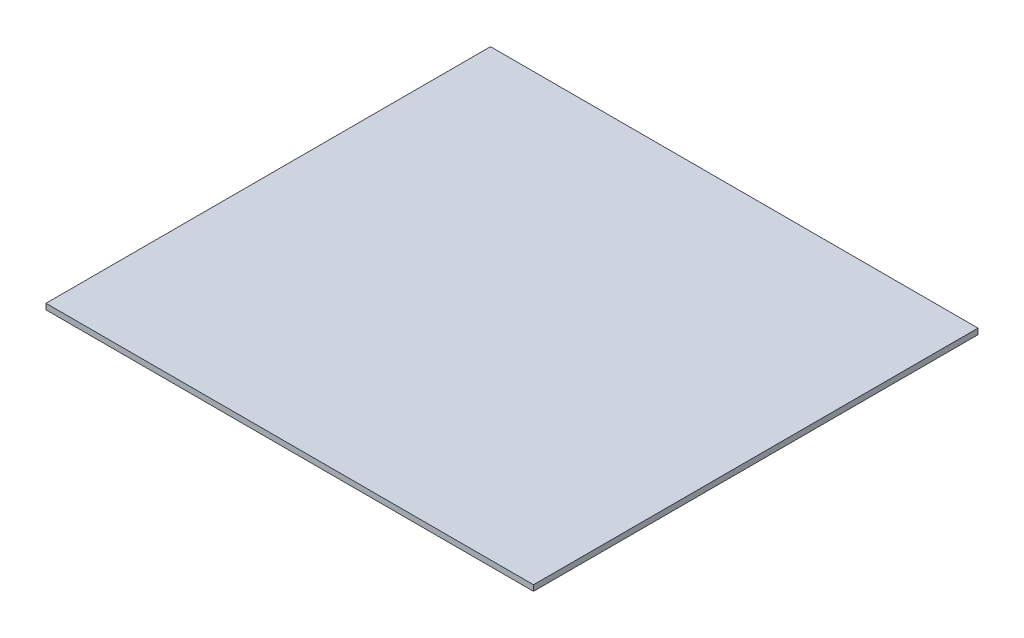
ISO-10303-21;
HEADER;
FILE_DESCRIPTION(('STEP AP214'),'2;1');
FILE_NAME('part.step','',(''),(''),'','','');
FILE_SCHEMA(('AUTOMOTIVE_DESIGN { 1 0 10303 214 1 1 1 1 }'));
ENDSEC;
DATA;
#1=APPLICATION_CONTEXT('core data for automotive mechanical design processes');
#2=APPLICATION_PROTOCOL_DEFINITION('international standard','automotive_design',2000,#1);
#3=PRODUCT_CONTEXT('',#1,'mechanical');
#4=PRODUCT('Part','Part','',(#3));
#5=PRODUCT_RELATED_PRODUCT_CATEGORY('part','',(#4));
#6=PRODUCT_DEFINITION_FORMATION('','',#4);
#7=PRODUCT_DEFINITION_CONTEXT('part definition',#1,'design');
#8=PRODUCT_DEFINITION('design','',#6,#7);
#9=PRODUCT_DEFINITION_SHAPE('','',#8);
#10=(LENGTH_UNIT() NAMED_UNIT(*) SI_UNIT(.MILLI.,.METRE.));
#11=(NAMED_UNIT(*) PLANE_ANGLE_UNIT() SI_UNIT($,.RADIAN.));
#12=(NAMED_UNIT(*) SI_UNIT($,.STERADIAN.) SOLID_ANGLE_UNIT());
#13=UNCERTAINTY_MEASURE_WITH_UNIT(LENGTH_MEASURE(1.E-05),#10,'distance_accuracy_value','');
#14=(GEOMETRIC_REPRESENTATION_CONTEXT(3) GLOBAL_UNCERTAINTY_ASSIGNED_CONTEXT((#13)) GLOBAL_UNIT_ASSIGNED_CONTEXT((#10,
#11,#12)) REPRESENTATION_CONTEXT('',''));
#15=CARTESIAN_POINT('',(0.,0.,0.));
#16=DIRECTION('',(0.,0.,1.));
#17=DIRECTION('',(1.,0.,0.));
#18=AXIS2_PLACEMENT_3D('',#15,#16,#17);
#19=CARTESIAN_POINT('',(108.072104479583,2.54,98.5395029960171));
#20=DIRECTION('',(-1.,0.,0.));
#21=DIRECTION('',(0.,0.,1.));
#22=AXIS2_PLACEMENT_3D('',#19,#20,#21);
#23=PLANE('',#22);
#24=DIRECTION('',(0.,0.,-1.));
#25=VECTOR('',#24,1.);
#26=CARTESIAN_POINT('',(108.072104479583,0.,98.5395029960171));
#27=LINE('',#26,#25);
#28=CARTESIAN_POINT('',(108.072104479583,0.,98.5395029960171));
#29=VERTEX_POINT('',#28);
#30=CARTESIAN_POINT('',(108.072104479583,0.,-98.5395029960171));
#31=VERTEX_POINT('',#30);
#32=EDGE_CURVE('E107',#29,#31,#27,.T.);
#33=ORIENTED_EDGE('',*,*,#32,.T.);
#34=DIRECTION('',(0.,-1.,0.));
#35=VECTOR('',#34,1.);
#36=CARTESIAN_POINT('',(108.072104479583,2.54,-98.5395029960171));
#37=LINE('',#36,#35);
#38=CARTESIAN_POINT('',(108.072104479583,2.54,-98.5395029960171));
#39=VERTEX_POINT('',#38);
#40=EDGE_CURVE('E11',#39,#31,#37,.T.);
#41=ORIENTED_EDGE('',*,*,#40,.F.);
#42=DIRECTION('',(0.,0.,-1.));
#43=VECTOR('',#42,1.);
#44=CARTESIAN_POINT('',(108.072104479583,2.54,98.5395029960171));
#45=LINE('',#44,#43);
#46=CARTESIAN_POINT('',(108.072104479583,2.54,98.5395029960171));
#47=VERTEX_POINT('',#46);
#48=EDGE_CURVE('E91',#47,#39,#45,.T.);
#49=ORIENTED_EDGE('',*,*,#48,.F.);
#50=DIRECTION('',(0.,-1.,0.));
#51=VECTOR('',#50,1.);
#52=CARTESIAN_POINT('',(108.072104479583,2.54,98.5395029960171));
#53=LINE('',#52,#51);
#54=EDGE_CURVE('E103',#47,#29,#53,.T.);
#55=ORIENTED_EDGE('',*,*,#54,.T.);
#56=EDGE_LOOP('',(#33,#41,#49,#55));
#57=FACE_BOUND('',#56,.T.);
#58=ADVANCED_FACE('F39',(#57),#23,.F.);
#59=CARTESIAN_POINT('',(-108.072104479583,2.54,-98.5395029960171));
#60=DIRECTION('',(0.,0.,1.));
#61=DIRECTION('',(1.,0.,0.));
#62=AXIS2_PLACEMENT_3D('',#59,#60,#61);
#63=PLANE('',#62);
#64=DIRECTION('',(-1.,0.,0.));
#65=VECTOR('',#64,1.);
#66=CARTESIAN_POINT('',(-108.072104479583,0.,-98.5395029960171));
#67=LINE('',#66,#65);
#68=CARTESIAN_POINT('',(-108.072104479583,0.,-98.5395029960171));
#69=VERTEX_POINT('',#68);
#70=EDGE_CURVE('E96',#31,#69,#67,.T.);
#71=ORIENTED_EDGE('',*,*,#70,.T.);
#72=DIRECTION('',(0.,-1.,0.));
#73=VECTOR('',#72,1.);
#74=CARTESIAN_POINT('',(-108.072104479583,2.54,-98.5395029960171));
#75=LINE('',#74,#73);
#76=CARTESIAN_POINT('',(-108.072104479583,2.54,-98.5395029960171));
#77=VERTEX_POINT('',#76);
#78=EDGE_CURVE('E48',#77,#69,#75,.T.);
#79=ORIENTED_EDGE('',*,*,#78,.F.);
#80=DIRECTION('',(-1.,0.,0.));
#81=VECTOR('',#80,1.);
#82=CARTESIAN_POINT('',(-108.072104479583,2.54,-98.5395029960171));
#83=LINE('',#82,#81);
#84=EDGE_CURVE('E86',#39,#77,#83,.T.);
#85=ORIENTED_EDGE('',*,*,#84,.F.);
#86=ORIENTED_EDGE('',*,*,#40,.T.);
#87=EDGE_LOOP('',(#71,#79,#85,#86));
#88=FACE_BOUND('',#87,.T.);
#89=ADVANCED_FACE('F95',(#88),#63,.F.);
#90=CARTESIAN_POINT('',(-108.072104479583,2.54,98.5395029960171));
#91=DIRECTION('',(1.,0.,0.));
#92=DIRECTION('',(0.,0.,-1.));
#93=AXIS2_PLACEMENT_3D('',#90,#91,#92);
#94=PLANE('',#93);
#95=DIRECTION('',(0.,0.,1.));
#96=VECTOR('',#95,1.);
#97=CARTESIAN_POINT('',(-108.072104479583,0.,98.5395029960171));
#98=LINE('',#97,#96);
#99=CARTESIAN_POINT('',(-108.072104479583,0.,98.5395029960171));
#100=VERTEX_POINT('',#99);
#101=EDGE_CURVE('E73',#69,#100,#98,.T.);
#102=ORIENTED_EDGE('',*,*,#101,.T.);
#103=DIRECTION('',(0.,-1.,0.));
#104=VECTOR('',#103,1.);
#105=CARTESIAN_POINT('',(-108.072104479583,2.54,98.5395029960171));
#106=LINE('',#105,#104);
#107=CARTESIAN_POINT('',(-108.072104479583,2.54,98.5395029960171));
#108=VERTEX_POINT('',#107);
#109=EDGE_CURVE('E98',#108,#100,#106,.T.);
#110=ORIENTED_EDGE('',*,*,#109,.F.);
#111=DIRECTION('',(0.,0.,1.));
#112=VECTOR('',#111,1.);
#113=CARTESIAN_POINT('',(-108.072104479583,2.54,98.5395029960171));
#114=LINE('',#113,#112);
#115=EDGE_CURVE('E89',#77,#108,#114,.T.);
#116=ORIENTED_EDGE('',*,*,#115,.F.);
#117=ORIENTED_EDGE('',*,*,#78,.T.);
#118=EDGE_LOOP('',(#102,#110,#116,#117));
#119=FACE_BOUND('',#118,.T.);
#120=ADVANCED_FACE('F99',(#119),#94,.F.);
#121=CARTESIAN_POINT('',(-108.072104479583,2.54,98.5395029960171));
#122=DIRECTION('',(0.,0.,-1.));
#123=DIRECTION('',(-1.,0.,0.));
#124=AXIS2_PLACEMENT_3D('',#121,#122,#123);
#125=PLANE('',#124);
#126=DIRECTION('',(1.,0.,0.));
#127=VECTOR('',#126,1.);
#128=CARTESIAN_POINT('',(-108.072104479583,0.,98.5395029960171));
#129=LINE('',#128,#127);
#130=EDGE_CURVE('E79',#100,#29,#129,.T.);
#131=ORIENTED_EDGE('',*,*,#130,.T.);
#132=ORIENTED_EDGE('',*,*,#54,.F.);
#133=DIRECTION('',(1.,0.,0.));
#134=VECTOR('',#133,1.);
#135=CARTESIAN_POINT('',(-108.072104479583,2.54,98.5395029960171));
#136=LINE('',#135,#134);
#137=EDGE_CURVE('E56',#108,#47,#136,.T.);
#138=ORIENTED_EDGE('',*,*,#137,.F.);
#139=ORIENTED_EDGE('',*,*,#109,.T.);
#140=EDGE_LOOP('',(#131,#132,#138,#139));
#141=FACE_BOUND('',#140,.T.);
#142=ADVANCED_FACE('F120',(#141),#125,.F.);
#143=CARTESIAN_POINT('',(0.,2.54,0.));
#144=DIRECTION('',(0.,-1.,0.));
#145=DIRECTION('',(0.,0.,-1.));
#146=AXIS2_PLACEMENT_3D('',#143,#144,#145);
#147=PLANE('',#146);
#148=ORIENTED_EDGE('',*,*,#48,.T.);
#149=ORIENTED_EDGE('',*,*,#84,.T.);
#150=ORIENTED_EDGE('',*,*,#115,.T.);
#151=ORIENTED_EDGE('',*,*,#137,.T.);
#152=EDGE_LOOP('',(#148,#149,#150,#151));
#153=FACE_BOUND('',#152,.T.);
#154=ADVANCED_FACE('F87',(#153),#147,.F.);
#155=CARTESIAN_POINT('',(0.,0.,0.));
#156=DIRECTION('',(0.,-1.,0.));
#157=DIRECTION('',(0.,0.,-1.));
#158=AXIS2_PLACEMENT_3D('',#155,#156,#157);
#159=PLANE('',#158);
#160=ORIENTED_EDGE('',*,*,#32,.F.);
#161=ORIENTED_EDGE('',*,*,#130,.F.);
#162=ORIENTED_EDGE('',*,*,#101,.F.);
#163=ORIENTED_EDGE('',*,*,#70,.F.);
#164=EDGE_LOOP('',(#160,#161,#162,#163));
#165=FACE_BOUND('',#164,.T.);
#166=ADVANCED_FACE('F123',(#165),#159,.T.);
#167=CLOSED_SHELL('',(#58,#89,#120,#142,#154,#166));
#168=MANIFOLD_SOLID_BREP('B2',#167);
#169=ADVANCED_BREP_SHAPE_REPRESENTATION('',(#18,#168),#14);
#170=SHAPE_DEFINITION_REPRESENTATION(#9,#169);
ENDSEC;
END-ISO-10303-21;
